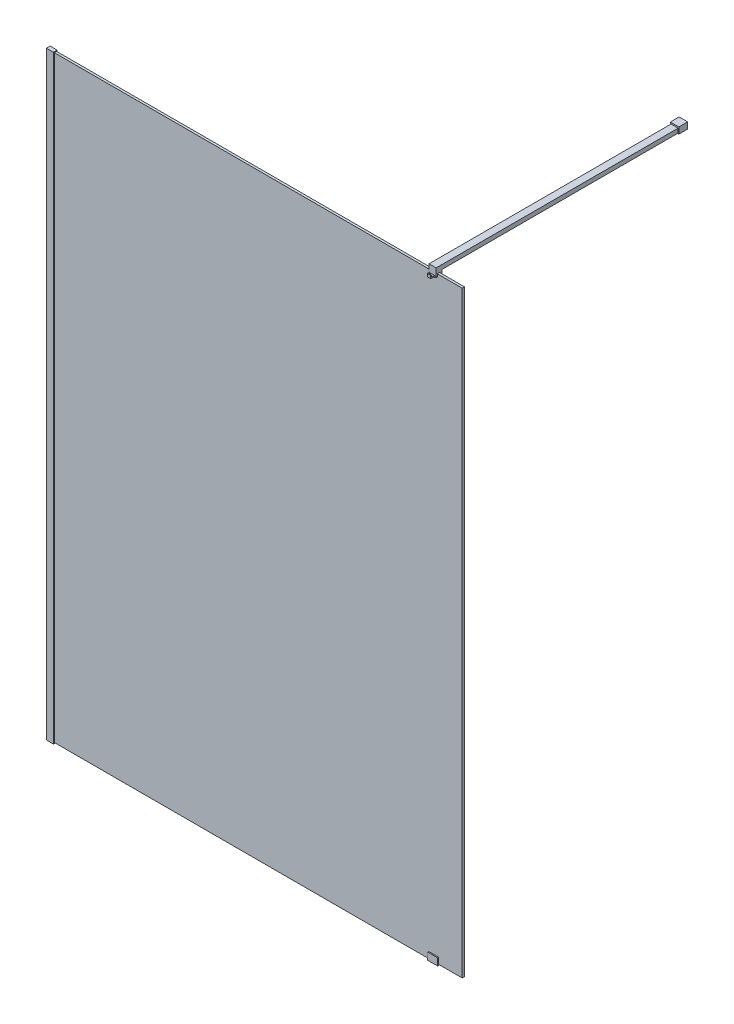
ISO-10303-21;
HEADER;
FILE_DESCRIPTION(('STEP AP214'),'2;1');
FILE_NAME('part.step','',(''),(''),'','','');
FILE_SCHEMA(('AUTOMOTIVE_DESIGN { 1 0 10303 214 1 1 1 1 }'));
ENDSEC;
DATA;
#1=APPLICATION_CONTEXT('core data for automotive mechanical design processes');
#2=APPLICATION_PROTOCOL_DEFINITION('international standard','automotive_design',2000,#1);
#3=PRODUCT_CONTEXT('',#1,'mechanical');
#4=PRODUCT('Part','Part','',(#3));
#5=PRODUCT_RELATED_PRODUCT_CATEGORY('part','',(#4));
#6=PRODUCT_DEFINITION_FORMATION('','',#4);
#7=PRODUCT_DEFINITION_CONTEXT('part definition',#1,'design');
#8=PRODUCT_DEFINITION('design','',#6,#7);
#9=PRODUCT_DEFINITION_SHAPE('','',#8);
#10=(LENGTH_UNIT() NAMED_UNIT(*) SI_UNIT(.MILLI.,.METRE.));
#11=(NAMED_UNIT(*) PLANE_ANGLE_UNIT() SI_UNIT($,.RADIAN.));
#12=(NAMED_UNIT(*) SI_UNIT($,.STERADIAN.) SOLID_ANGLE_UNIT());
#13=UNCERTAINTY_MEASURE_WITH_UNIT(LENGTH_MEASURE(1.E-05),#10,'distance_accuracy_value','');
#14=(GEOMETRIC_REPRESENTATION_CONTEXT(3) GLOBAL_UNCERTAINTY_ASSIGNED_CONTEXT((#13)) GLOBAL_UNIT_ASSIGNED_CONTEXT((#10,
#11,#12)) REPRESENTATION_CONTEXT('',''));
#15=CARTESIAN_POINT('',(0.,0.,0.));
#16=DIRECTION('',(0.,0.,1.));
#17=DIRECTION('',(1.,0.,0.));
#18=AXIS2_PLACEMENT_3D('',#15,#16,#17);
#19=CARTESIAN_POINT('',(1370.95,2090.,-19.4000000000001));
#20=DIRECTION('',(-1.,0.,0.));
#21=DIRECTION('',(0.,0.,1.));
#22=AXIS2_PLACEMENT_3D('',#19,#20,#21);
#23=PLANE('',#22);
#24=DIRECTION('',(0.,-1.,0.));
#25=VECTOR('',#24,1.);
#26=CARTESIAN_POINT('',(1370.95,2090.,-850.03));
#27=LINE('',#26,#25);
#28=CARTESIAN_POINT('',(1370.95,2120.,-850.03));
#29=VERTEX_POINT('',#28);
#30=CARTESIAN_POINT('',(1370.95,2105.,-850.03));
#31=VERTEX_POINT('',#30);
#32=EDGE_CURVE('E61',#29,#31,#27,.T.);
#33=ORIENTED_EDGE('',*,*,#32,.F.);
#34=DIRECTION('',(0.,0.,1.));
#35=VECTOR('',#34,1.);
#36=CARTESIAN_POINT('',(1370.95,2120.,0.599999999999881));
#37=LINE('',#36,#35);
#38=CARTESIAN_POINT('',(1370.95,2120.,0.599999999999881));
#39=VERTEX_POINT('',#38);
#40=EDGE_CURVE('E386',#29,#39,#37,.T.);
#41=ORIENTED_EDGE('',*,*,#40,.T.);
#42=DIRECTION('',(0.,-1.,0.));
#43=VECTOR('',#42,1.);
#44=CARTESIAN_POINT('',(1370.95,2094.,0.599999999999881));
#45=LINE('',#44,#43);
#46=CARTESIAN_POINT('',(1370.95,2094.,0.599999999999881));
#47=VERTEX_POINT('',#46);
#48=EDGE_CURVE('E388',#39,#47,#45,.T.);
#49=ORIENTED_EDGE('',*,*,#48,.T.);
#50=DIRECTION('',(0.,1.,0.));
#51=VECTOR('',#50,1.);
#52=CARTESIAN_POINT('',(1370.95,2090.,0.599999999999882));
#53=LINE('',#52,#51);
#54=CARTESIAN_POINT('',(1370.95,2090.,0.599999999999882));
#55=VERTEX_POINT('',#54);
#56=EDGE_CURVE('E332',#55,#47,#53,.T.);
#57=ORIENTED_EDGE('',*,*,#56,.F.);
#58=DIRECTION('',(0.,0.,-1.));
#59=VECTOR('',#58,1.);
#60=CARTESIAN_POINT('',(1370.95,2090.,-3.40000000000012));
#61=LINE('',#60,#59);
#62=CARTESIAN_POINT('',(1370.95,2090.,-3.40000000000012));
#63=VERTEX_POINT('',#62);
#64=EDGE_CURVE('E362',#55,#63,#61,.T.);
#65=ORIENTED_EDGE('',*,*,#64,.T.);
#66=DIRECTION('',(0.,1.,-1.30407837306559E-13));
#67=VECTOR('',#66,1.);
#68=CARTESIAN_POINT('',(1370.95,2100.,-3.40000000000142));
#69=LINE('',#68,#67);
#70=CARTESIAN_POINT('',(1370.95,2100.,-3.40000000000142));
#71=VERTEX_POINT('',#70);
#72=EDGE_CURVE('E392',#63,#71,#69,.T.);
#73=ORIENTED_EDGE('',*,*,#72,.T.);
#74=DIRECTION('',(0.,0.,-1.));
#75=VECTOR('',#74,1.);
#76=CARTESIAN_POINT('',(1370.95,2100.,-11.4000000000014));
#77=LINE('',#76,#75);
#78=CARTESIAN_POINT('',(1370.95,2100.,-11.4000000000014));
#79=VERTEX_POINT('',#78);
#80=EDGE_CURVE('E394',#71,#79,#77,.T.);
#81=ORIENTED_EDGE('',*,*,#80,.T.);
#82=DIRECTION('',(0.,-1.,1.30451205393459E-13));
#83=VECTOR('',#82,1.);
#84=CARTESIAN_POINT('',(1370.95,2090.,-11.4000000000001));
#85=LINE('',#84,#83);
#86=CARTESIAN_POINT('',(1370.95,2090.,-11.4000000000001));
#87=VERTEX_POINT('',#86);
#88=EDGE_CURVE('E395',#79,#87,#85,.T.);
#89=ORIENTED_EDGE('',*,*,#88,.T.);
#90=DIRECTION('',(0.,0.,-1.));
#91=VECTOR('',#90,1.);
#92=CARTESIAN_POINT('',(1370.95,2090.,-19.4000000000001));
#93=LINE('',#92,#91);
#94=CARTESIAN_POINT('',(1370.95,2090.,-19.4000000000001));
#95=VERTEX_POINT('',#94);
#96=EDGE_CURVE('E283',#87,#95,#93,.T.);
#97=ORIENTED_EDGE('',*,*,#96,.T.);
#98=DIRECTION('',(0.,1.,0.));
#99=VECTOR('',#98,1.);
#100=CARTESIAN_POINT('',(1370.95,2120.,-19.4000000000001));
#101=LINE('',#100,#99);
#102=CARTESIAN_POINT('',(1370.95,2105.,-19.4000000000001));
#103=VERTEX_POINT('',#102);
#104=EDGE_CURVE('E249',#95,#103,#101,.T.);
#105=ORIENTED_EDGE('',*,*,#104,.T.);
#106=DIRECTION('',(0.,0.,-1.));
#107=VECTOR('',#106,1.);
#108=CARTESIAN_POINT('',(1370.95,2105.,-881.03));
#109=LINE('',#108,#107);
#110=EDGE_CURVE('E248',#103,#31,#109,.T.);
#111=ORIENTED_EDGE('',*,*,#110,.T.);
#112=EDGE_LOOP('',(#33,#41,#49,#57,#65,#73,#81,#89,#97,#105,#111));
#113=FACE_BOUND('',#112,.T.);
#114=ADVANCED_FACE('F46',(#113),#23,.F.);
#115=CARTESIAN_POINT('',(1345.95,2090.,-19.4000000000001));
#116=DIRECTION('',(-1.,0.,0.));
#117=DIRECTION('',(0.,0.,1.));
#118=AXIS2_PLACEMENT_3D('',#115,#116,#117);
#119=PLANE('',#118);
#120=DIRECTION('',(0.,0.,1.));
#121=VECTOR('',#120,1.);
#122=CARTESIAN_POINT('',(1345.95,2120.,0.599999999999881));
#123=LINE('',#122,#121);
#124=CARTESIAN_POINT('',(1345.95,2120.,-850.03));
#125=VERTEX_POINT('',#124);
#126=CARTESIAN_POINT('',(1345.95,2120.,0.599999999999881));
#127=VERTEX_POINT('',#126);
#128=EDGE_CURVE('E272',#125,#127,#123,.T.);
#129=ORIENTED_EDGE('',*,*,#128,.F.);
#130=DIRECTION('',(0.,-1.,0.));
#131=VECTOR('',#130,1.);
#132=CARTESIAN_POINT('',(1345.95,2090.,-850.03));
#133=LINE('',#132,#131);
#134=CARTESIAN_POINT('',(1345.95,2105.,-850.03));
#135=VERTEX_POINT('',#134);
#136=EDGE_CURVE('E230',#125,#135,#133,.T.);
#137=ORIENTED_EDGE('',*,*,#136,.T.);
#138=DIRECTION('',(0.,0.,1.));
#139=VECTOR('',#138,1.);
#140=CARTESIAN_POINT('',(1345.95,2105.,-881.03));
#141=LINE('',#140,#139);
#142=CARTESIAN_POINT('',(1345.95,2105.,-19.4000000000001));
#143=VERTEX_POINT('',#142);
#144=EDGE_CURVE('E238',#135,#143,#141,.T.);
#145=ORIENTED_EDGE('',*,*,#144,.T.);
#146=DIRECTION('',(0.,1.,0.));
#147=VECTOR('',#146,1.);
#148=CARTESIAN_POINT('',(1345.95,2120.,-19.4000000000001));
#149=LINE('',#148,#147);
#150=CARTESIAN_POINT('',(1345.95,2090.,-19.4000000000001));
#151=VERTEX_POINT('',#150);
#152=EDGE_CURVE('E262',#151,#143,#149,.T.);
#153=ORIENTED_EDGE('',*,*,#152,.F.);
#154=DIRECTION('',(0.,0.,-1.));
#155=VECTOR('',#154,1.);
#156=CARTESIAN_POINT('',(1345.95,2090.,-19.4000000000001));
#157=LINE('',#156,#155);
#158=CARTESIAN_POINT('',(1345.95,2090.,-11.4000000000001));
#159=VERTEX_POINT('',#158);
#160=EDGE_CURVE('E296',#159,#151,#157,.T.);
#161=ORIENTED_EDGE('',*,*,#160,.F.);
#162=DIRECTION('',(0.,-1.,1.30451205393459E-13));
#163=VECTOR('',#162,1.);
#164=CARTESIAN_POINT('',(1345.95,2090.,-11.4000000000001));
#165=LINE('',#164,#163);
#166=CARTESIAN_POINT('',(1345.95,2100.,-11.4000000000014));
#167=VERTEX_POINT('',#166);
#168=EDGE_CURVE('E294',#167,#159,#165,.T.);
#169=ORIENTED_EDGE('',*,*,#168,.F.);
#170=DIRECTION('',(0.,0.,-1.));
#171=VECTOR('',#170,1.);
#172=CARTESIAN_POINT('',(1345.95,2100.,-11.4000000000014));
#173=LINE('',#172,#171);
#174=CARTESIAN_POINT('',(1345.95,2100.,-3.40000000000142));
#175=VERTEX_POINT('',#174);
#176=EDGE_CURVE('E292',#175,#167,#173,.T.);
#177=ORIENTED_EDGE('',*,*,#176,.F.);
#178=DIRECTION('',(0.,1.,-1.30407837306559E-13));
#179=VECTOR('',#178,1.);
#180=CARTESIAN_POINT('',(1345.95,2100.,-3.40000000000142));
#181=LINE('',#180,#179);
#182=CARTESIAN_POINT('',(1345.95,2090.,-3.40000000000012));
#183=VERTEX_POINT('',#182);
#184=EDGE_CURVE('E290',#183,#175,#181,.T.);
#185=ORIENTED_EDGE('',*,*,#184,.F.);
#186=DIRECTION('',(0.,0.,-1.));
#187=VECTOR('',#186,1.);
#188=CARTESIAN_POINT('',(1345.95,2090.,-3.40000000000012));
#189=LINE('',#188,#187);
#190=CARTESIAN_POINT('',(1345.95,2090.,0.599999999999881));
#191=VERTEX_POINT('',#190);
#192=EDGE_CURVE('E288',#191,#183,#189,.T.);
#193=ORIENTED_EDGE('',*,*,#192,.F.);
#194=DIRECTION('',(0.,1.,0.));
#195=VECTOR('',#194,1.);
#196=CARTESIAN_POINT('',(1345.95,2090.,0.599999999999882));
#197=LINE('',#196,#195);
#198=CARTESIAN_POINT('',(1345.95,2094.,0.599999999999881));
#199=VERTEX_POINT('',#198);
#200=EDGE_CURVE('E329',#191,#199,#197,.T.);
#201=ORIENTED_EDGE('',*,*,#200,.T.);
#202=DIRECTION('',(0.,-1.,0.));
#203=VECTOR('',#202,1.);
#204=CARTESIAN_POINT('',(1345.95,2094.,0.599999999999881));
#205=LINE('',#204,#203);
#206=EDGE_CURVE('E274',#127,#199,#205,.T.);
#207=ORIENTED_EDGE('',*,*,#206,.F.);
#208=EDGE_LOOP('',(#129,#137,#145,#153,#161,#169,#177,#185,#193,#201,#207));
#209=FACE_BOUND('',#208,.T.);
#210=ADVANCED_FACE('F259',(#209),#119,.T.);
#211=CARTESIAN_POINT('',(1370.95,2120.,0.599999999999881));
#212=DIRECTION('',(0.,-1.,0.));
#213=DIRECTION('',(0.,0.,-1.));
#214=AXIS2_PLACEMENT_3D('',#211,#212,#213);
#215=PLANE('',#214);
#216=DIRECTION('',(1.,0.,0.));
#217=VECTOR('',#216,1.);
#218=CARTESIAN_POINT('',(1370.95,2120.,-850.03));
#219=LINE('',#218,#217);
#220=EDGE_CURVE('E68',#125,#29,#219,.T.);
#221=ORIENTED_EDGE('',*,*,#220,.F.);
#222=ORIENTED_EDGE('',*,*,#128,.T.);
#223=DIRECTION('',(-1.,0.,0.));
#224=VECTOR('',#223,1.);
#225=CARTESIAN_POINT('',(1370.95,2120.,0.599999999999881));
#226=LINE('',#225,#224);
#227=EDGE_CURVE('E326',#39,#127,#226,.T.);
#228=ORIENTED_EDGE('',*,*,#227,.F.);
#229=ORIENTED_EDGE('',*,*,#40,.F.);
#230=EDGE_LOOP('',(#221,#222,#228,#229));
#231=FACE_BOUND('',#230,.T.);
#232=ADVANCED_FACE('F437',(#231),#215,.F.);
#233=CARTESIAN_POINT('',(1345.95,2105.,-19.4000000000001));
#234=DIRECTION('',(0.,1.,0.));
#235=DIRECTION('',(0.,0.,1.));
#236=AXIS2_PLACEMENT_3D('',#233,#234,#235);
#237=PLANE('',#236);
#238=DIRECTION('',(-1.,0.,0.));
#239=VECTOR('',#238,1.);
#240=CARTESIAN_POINT('',(1345.95,2105.,-850.03));
#241=LINE('',#240,#239);
#242=EDGE_CURVE('E12',#31,#135,#241,.T.);
#243=ORIENTED_EDGE('',*,*,#242,.F.);
#244=ORIENTED_EDGE('',*,*,#110,.F.);
#245=DIRECTION('',(1.,0.,0.));
#246=VECTOR('',#245,1.);
#247=CARTESIAN_POINT('',(1345.95,2105.,-19.4000000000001));
#248=LINE('',#247,#246);
#249=EDGE_CURVE('E244',#143,#103,#248,.T.);
#250=ORIENTED_EDGE('',*,*,#249,.F.);
#251=ORIENTED_EDGE('',*,*,#144,.F.);
#252=EDGE_LOOP('',(#243,#244,#250,#251));
#253=FACE_BOUND('',#252,.T.);
#254=ADVANCED_FACE('F265',(#253),#237,.F.);
#255=CARTESIAN_POINT('',(1370.95,2094.,9.84506801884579));
#256=DIRECTION('',(0.,-1.,0.));
#257=DIRECTION('',(0.,0.,-1.));
#258=AXIS2_PLACEMENT_3D('',#255,#256,#257);
#259=PLANE('',#258);
#260=DIRECTION('',(-0.906307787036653,0.,-0.422618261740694));
#261=VECTOR('',#260,1.);
#262=CARTESIAN_POINT('',(1370.02591161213,2094.,11.8267819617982));
#263=LINE('',#262,#261);
#264=CARTESIAN_POINT('',(1352.45,2094.,3.6309997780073));
#265=VERTEX_POINT('',#264);
#266=EDGE_CURVE('E365',#265,#199,#263,.T.);
#267=ORIENTED_EDGE('',*,*,#266,.F.);
#268=DIRECTION('',(0.,0.,-1.));
#269=VECTOR('',#268,1.);
#270=CARTESIAN_POINT('',(1352.45,2094.,9.84506801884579));
#271=LINE('',#270,#269);
#272=CARTESIAN_POINT('',(1352.45,2094.,9.84506801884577));
#273=VERTEX_POINT('',#272);
#274=EDGE_CURVE('E273',#273,#265,#271,.T.);
#275=ORIENTED_EDGE('',*,*,#274,.F.);
#276=DIRECTION('',(-1.,0.,0.));
#277=VECTOR('',#276,1.);
#278=CARTESIAN_POINT('',(1370.95,2094.,9.84506801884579));
#279=LINE('',#278,#277);
#280=CARTESIAN_POINT('',(1364.45,2094.,9.84506801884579));
#281=VERTEX_POINT('',#280);
#282=EDGE_CURVE('E320',#281,#273,#279,.T.);
#283=ORIENTED_EDGE('',*,*,#282,.F.);
#284=DIRECTION('',(0.,0.,1.));
#285=VECTOR('',#284,1.);
#286=CARTESIAN_POINT('',(1364.45,2094.,9.84506801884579));
#287=LINE('',#286,#285);
#288=CARTESIAN_POINT('',(1364.45,2094.,3.63099977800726));
#289=VERTEX_POINT('',#288);
#290=EDGE_CURVE('E379',#289,#281,#287,.T.);
#291=ORIENTED_EDGE('',*,*,#290,.F.);
#292=DIRECTION('',(-0.906307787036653,0.,0.422618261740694));
#293=VECTOR('',#292,1.);
#294=CARTESIAN_POINT('',(1367.40893350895,2094.,2.25122642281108));
#295=LINE('',#294,#293);
#296=EDGE_CURVE('E364',#47,#289,#295,.T.);
#297=ORIENTED_EDGE('',*,*,#296,.F.);
#298=DIRECTION('',(-1.,0.,0.));
#299=VECTOR('',#298,1.);
#300=CARTESIAN_POINT('',(1370.95,2094.,0.599999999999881));
#301=LINE('',#300,#299);
#302=EDGE_CURVE('E323',#47,#199,#301,.T.);
#303=ORIENTED_EDGE('',*,*,#302,.T.);
#304=EDGE_LOOP('',(#267,#275,#283,#291,#297,#303));
#305=FACE_BOUND('',#304,.T.);
#306=ADVANCED_FACE('F424',(#305),#259,.F.);
#307=CARTESIAN_POINT('',(1370.95,2100.,10.3700000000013));
#308=DIRECTION('',(0.,-0.087155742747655,0.996194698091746));
#309=DIRECTION('',(0.,-0.996194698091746,-0.087155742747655));
#310=AXIS2_PLACEMENT_3D('',#307,#308,#309);
#311=PLANE('',#310);
#312=DIRECTION('',(0.,-0.996194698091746,-0.087155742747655));
#313=VECTOR('',#312,1.);
#314=CARTESIAN_POINT('',(1352.45,2100.,10.3700000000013));
#315=LINE('',#314,#313);
#316=CARTESIAN_POINT('',(1352.45,2100.,10.3700000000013));
#317=VERTEX_POINT('',#316);
#318=EDGE_CURVE('E276',#317,#273,#315,.T.);
#319=ORIENTED_EDGE('',*,*,#318,.F.);
#320=DIRECTION('',(-1.,0.,0.));
#321=VECTOR('',#320,1.);
#322=CARTESIAN_POINT('',(1370.95,2100.,10.3700000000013));
#323=LINE('',#322,#321);
#324=CARTESIAN_POINT('',(1364.45,2100.,10.3700000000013));
#325=VERTEX_POINT('',#324);
#326=EDGE_CURVE('E317',#325,#317,#323,.T.);
#327=ORIENTED_EDGE('',*,*,#326,.F.);
#328=DIRECTION('',(0.,0.996194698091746,0.087155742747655));
#329=VECTOR('',#328,1.);
#330=CARTESIAN_POINT('',(1364.45,2100.,10.3700000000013));
#331=LINE('',#330,#329);
#332=EDGE_CURVE('E376',#281,#325,#331,.T.);
#333=ORIENTED_EDGE('',*,*,#332,.F.);
#334=ORIENTED_EDGE('',*,*,#282,.T.);
#335=EDGE_LOOP('',(#319,#327,#333,#334));
#336=FACE_BOUND('',#335,.T.);
#337=ADVANCED_FACE('F428',(#336),#311,.F.);
#338=CARTESIAN_POINT('',(1370.95,2100.,13.3700000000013));
#339=DIRECTION('',(0.,-1.,1.48029736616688E-13));
#340=DIRECTION('',(0.,-1.48029736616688E-13,-1.));
#341=AXIS2_PLACEMENT_3D('',#338,#339,#340);
#342=PLANE('',#341);
#343=DIRECTION('',(0.,-1.48029736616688E-13,-1.));
#344=VECTOR('',#343,1.);
#345=CARTESIAN_POINT('',(1352.45,2100.,13.3700000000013));
#346=LINE('',#345,#344);
#347=CARTESIAN_POINT('',(1352.45,2100.,13.3700000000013));
#348=VERTEX_POINT('',#347);
#349=EDGE_CURVE('E382',#348,#317,#346,.T.);
#350=ORIENTED_EDGE('',*,*,#349,.F.);
#351=DIRECTION('',(-1.,0.,0.));
#352=VECTOR('',#351,1.);
#353=CARTESIAN_POINT('',(1370.95,2100.,13.3700000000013));
#354=LINE('',#353,#352);
#355=CARTESIAN_POINT('',(1364.45,2100.,13.3700000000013));
#356=VERTEX_POINT('',#355);
#357=EDGE_CURVE('E314',#356,#348,#354,.T.);
#358=ORIENTED_EDGE('',*,*,#357,.F.);
#359=DIRECTION('',(0.,1.48029736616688E-13,1.));
#360=VECTOR('',#359,1.);
#361=CARTESIAN_POINT('',(1364.45,2100.,13.3700000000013));
#362=LINE('',#361,#360);
#363=EDGE_CURVE('E368',#325,#356,#362,.T.);
#364=ORIENTED_EDGE('',*,*,#363,.F.);
#365=ORIENTED_EDGE('',*,*,#326,.T.);
#366=EDGE_LOOP('',(#350,#358,#364,#365));
#367=FACE_BOUND('',#366,.T.);
#368=ADVANCED_FACE('F431',(#367),#342,.F.);
#369=CARTESIAN_POINT('',(1370.95,2090.,13.3700000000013));
#370=DIRECTION('',(0.,0.,-1.));
#371=DIRECTION('',(0.,1.,0.));
#372=AXIS2_PLACEMENT_3D('',#369,#370,#371);
#373=PLANE('',#372);
#374=ORIENTED_EDGE('',*,*,#357,.T.);
#375=DIRECTION('',(0.,-1.,0.));
#376=VECTOR('',#375,1.);
#377=CARTESIAN_POINT('',(1352.45,7948.62948032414,13.3700000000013));
#378=LINE('',#377,#376);
#379=CARTESIAN_POINT('',(1352.45,2090.,13.3700000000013));
#380=VERTEX_POINT('',#379);
#381=EDGE_CURVE('E345',#348,#380,#378,.T.);
#382=ORIENTED_EDGE('',*,*,#381,.T.);
#383=DIRECTION('',(-1.,0.,0.));
#384=VECTOR('',#383,1.);
#385=CARTESIAN_POINT('',(1370.95,2090.,13.3700000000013));
#386=LINE('',#385,#384);
#387=CARTESIAN_POINT('',(1364.45,2090.,13.3700000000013));
#388=VERTEX_POINT('',#387);
#389=EDGE_CURVE('E311',#388,#380,#386,.T.);
#390=ORIENTED_EDGE('',*,*,#389,.F.);
#391=DIRECTION('',(0.,-1.,0.));
#392=VECTOR('',#391,1.);
#393=CARTESIAN_POINT('',(1364.45,7948.62948032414,13.3700000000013));
#394=LINE('',#393,#392);
#395=EDGE_CURVE('E355',#356,#388,#394,.T.);
#396=ORIENTED_EDGE('',*,*,#395,.F.);
#397=EDGE_LOOP('',(#374,#382,#390,#396));
#398=FACE_BOUND('',#397,.T.);
#399=ADVANCED_FACE('F353',(#398),#373,.F.);
#400=CARTESIAN_POINT('',(1370.95,2090.,-3.40000000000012));
#401=DIRECTION('',(0.,1.,0.));
#402=DIRECTION('',(0.,0.,1.));
#403=AXIS2_PLACEMENT_3D('',#400,#401,#402);
#404=PLANE('',#403);
#405=DIRECTION('',(0.906307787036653,0.,0.422618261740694));
#406=VECTOR('',#405,1.);
#407=CARTESIAN_POINT('',(1364.95275623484,2090.,9.46113075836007));
#408=LINE('',#407,#406);
#409=CARTESIAN_POINT('',(1352.45,2090.,3.6309997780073));
#410=VERTEX_POINT('',#409);
#411=EDGE_CURVE('E370',#191,#410,#408,.T.);
#412=ORIENTED_EDGE('',*,*,#411,.F.);
#413=ORIENTED_EDGE('',*,*,#192,.T.);
#414=DIRECTION('',(-1.,0.,0.));
#415=VECTOR('',#414,1.);
#416=CARTESIAN_POINT('',(1370.95,2090.,-3.40000000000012));
#417=LINE('',#416,#415);
#418=EDGE_CURVE('E308',#63,#183,#417,.T.);
#419=ORIENTED_EDGE('',*,*,#418,.F.);
#420=ORIENTED_EDGE('',*,*,#64,.F.);
#421=DIRECTION('',(0.906307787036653,0.,-0.422618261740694));
#422=VECTOR('',#421,1.);
#423=CARTESIAN_POINT('',(1372.48208888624,2090.,-0.114424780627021));
#424=LINE('',#423,#422);
#425=CARTESIAN_POINT('',(1364.45,2090.,3.6309997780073));
#426=VERTEX_POINT('',#425);
#427=EDGE_CURVE('E360',#426,#55,#424,.T.);
#428=ORIENTED_EDGE('',*,*,#427,.F.);
#429=DIRECTION('',(0.,0.,-1.));
#430=VECTOR('',#429,1.);
#431=CARTESIAN_POINT('',(1364.45,2090.,-3.40000000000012));
#432=LINE('',#431,#430);
#433=EDGE_CURVE('E334',#388,#426,#432,.T.);
#434=ORIENTED_EDGE('',*,*,#433,.F.);
#435=ORIENTED_EDGE('',*,*,#389,.T.);
#436=DIRECTION('',(0.,0.,1.));
#437=VECTOR('',#436,1.);
#438=CARTESIAN_POINT('',(1352.45,2090.,-3.40000000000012));
#439=LINE('',#438,#437);
#440=EDGE_CURVE('E54',#410,#380,#439,.T.);
#441=ORIENTED_EDGE('',*,*,#440,.F.);
#442=EDGE_LOOP('',(#412,#413,#419,#420,#428,#434,#435,#441));
#443=FACE_BOUND('',#442,.T.);
#444=ADVANCED_FACE('F357',(#443),#404,.F.);
#445=CARTESIAN_POINT('',(1370.95,2120.,-19.4000000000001));
#446=DIRECTION('',(0.,0.,1.));
#447=DIRECTION('',(0.,-1.,0.));
#448=AXIS2_PLACEMENT_3D('',#445,#446,#447);
#449=PLANE('',#448);
#450=ORIENTED_EDGE('',*,*,#152,.T.);
#451=ORIENTED_EDGE('',*,*,#249,.T.);
#452=ORIENTED_EDGE('',*,*,#104,.F.);
#453=DIRECTION('',(-1.,0.,0.));
#454=VECTOR('',#453,1.);
#455=CARTESIAN_POINT('',(1370.95,2090.,-19.4000000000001));
#456=LINE('',#455,#454);
#457=EDGE_CURVE('E271',#95,#151,#456,.T.);
#458=ORIENTED_EDGE('',*,*,#457,.T.);
#459=EDGE_LOOP('',(#450,#451,#452,#458));
#460=FACE_BOUND('',#459,.T.);
#461=ADVANCED_FACE('F48',(#460),#449,.F.);
#462=CARTESIAN_POINT('',(1370.95,2094.,0.599999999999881));
#463=DIRECTION('',(0.,0.,-1.));
#464=DIRECTION('',(0.,1.,0.));
#465=AXIS2_PLACEMENT_3D('',#462,#463,#464);
#466=PLANE('',#465);
#467=ORIENTED_EDGE('',*,*,#206,.T.);
#468=ORIENTED_EDGE('',*,*,#302,.F.);
#469=ORIENTED_EDGE('',*,*,#48,.F.);
#470=ORIENTED_EDGE('',*,*,#227,.T.);
#471=EDGE_LOOP('',(#467,#468,#469,#470));
#472=FACE_BOUND('',#471,.T.);
#473=ADVANCED_FACE('F435',(#472),#466,.F.);
#474=CARTESIAN_POINT('',(1370.95,2100.,-3.40000000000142));
#475=DIRECTION('',(0.,1.30407837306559E-13,1.));
#476=DIRECTION('',(0.,-1.,1.30407837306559E-13));
#477=AXIS2_PLACEMENT_3D('',#474,#475,#476);
#478=PLANE('',#477);
#479=ORIENTED_EDGE('',*,*,#184,.T.);
#480=DIRECTION('',(-1.,0.,0.));
#481=VECTOR('',#480,1.);
#482=CARTESIAN_POINT('',(1370.95,2100.,-3.40000000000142));
#483=LINE('',#482,#481);
#484=EDGE_CURVE('E305',#71,#175,#483,.T.);
#485=ORIENTED_EDGE('',*,*,#484,.F.);
#486=ORIENTED_EDGE('',*,*,#72,.F.);
#487=ORIENTED_EDGE('',*,*,#418,.T.);
#488=EDGE_LOOP('',(#479,#485,#486,#487));
#489=FACE_BOUND('',#488,.T.);
#490=ADVANCED_FACE('F413',(#489),#478,.F.);
#491=CARTESIAN_POINT('',(1370.95,2100.,-11.4000000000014));
#492=DIRECTION('',(0.,1.,0.));
#493=DIRECTION('',(0.,0.,1.));
#494=AXIS2_PLACEMENT_3D('',#491,#492,#493);
#495=PLANE('',#494);
#496=ORIENTED_EDGE('',*,*,#176,.T.);
#497=DIRECTION('',(-1.,0.,0.));
#498=VECTOR('',#497,1.);
#499=CARTESIAN_POINT('',(1370.95,2100.,-11.4000000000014));
#500=LINE('',#499,#498);
#501=EDGE_CURVE('E302',#79,#167,#500,.T.);
#502=ORIENTED_EDGE('',*,*,#501,.F.);
#503=ORIENTED_EDGE('',*,*,#80,.F.);
#504=ORIENTED_EDGE('',*,*,#484,.T.);
#505=EDGE_LOOP('',(#496,#502,#503,#504));
#506=FACE_BOUND('',#505,.T.);
#507=ADVANCED_FACE('F409',(#506),#495,.F.);
#508=CARTESIAN_POINT('',(1370.95,2090.,-11.4000000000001));
#509=DIRECTION('',(0.,-1.30451205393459E-13,-1.));
#510=DIRECTION('',(0.,1.,-1.30451205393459E-13));
#511=AXIS2_PLACEMENT_3D('',#508,#509,#510);
#512=PLANE('',#511);
#513=ORIENTED_EDGE('',*,*,#168,.T.);
#514=DIRECTION('',(-1.,0.,0.));
#515=VECTOR('',#514,1.);
#516=CARTESIAN_POINT('',(1370.95,2090.,-11.4000000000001));
#517=LINE('',#516,#515);
#518=EDGE_CURVE('E299',#87,#159,#517,.T.);
#519=ORIENTED_EDGE('',*,*,#518,.F.);
#520=ORIENTED_EDGE('',*,*,#88,.F.);
#521=ORIENTED_EDGE('',*,*,#501,.T.);
#522=EDGE_LOOP('',(#513,#519,#520,#521));
#523=FACE_BOUND('',#522,.T.);
#524=ADVANCED_FACE('F405',(#523),#512,.F.);
#525=CARTESIAN_POINT('',(1370.95,2090.,-19.4000000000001));
#526=DIRECTION('',(0.,1.,0.));
#527=DIRECTION('',(0.,0.,1.));
#528=AXIS2_PLACEMENT_3D('',#525,#526,#527);
#529=PLANE('',#528);
#530=ORIENTED_EDGE('',*,*,#160,.T.);
#531=ORIENTED_EDGE('',*,*,#457,.F.);
#532=ORIENTED_EDGE('',*,*,#96,.F.);
#533=ORIENTED_EDGE('',*,*,#518,.T.);
#534=EDGE_LOOP('',(#530,#531,#532,#533));
#535=FACE_BOUND('',#534,.T.);
#536=ADVANCED_FACE('F400',(#535),#529,.F.);
#537=CARTESIAN_POINT('',(1345.95,7948.62948032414,0.599999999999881));
#538=DIRECTION('',(-0.422618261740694,0.,0.906307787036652));
#539=DIRECTION('',(0.906307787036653,0.,0.422618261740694));
#540=AXIS2_PLACEMENT_3D('',#537,#538,#539);
#541=PLANE('',#540);
#542=DIRECTION('',(0.,-1.,0.));
#543=VECTOR('',#542,1.);
#544=CARTESIAN_POINT('',(1352.45,7948.62948032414,3.6309997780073));
#545=LINE('',#544,#543);
#546=EDGE_CURVE('E348',#265,#410,#545,.T.);
#547=ORIENTED_EDGE('',*,*,#546,.F.);
#548=ORIENTED_EDGE('',*,*,#266,.T.);
#549=ORIENTED_EDGE('',*,*,#200,.F.);
#550=ORIENTED_EDGE('',*,*,#411,.T.);
#551=EDGE_LOOP('',(#547,#548,#549,#550));
#552=FACE_BOUND('',#551,.T.);
#553=ADVANCED_FACE('F432',(#552),#541,.T.);
#554=CARTESIAN_POINT('',(1352.45,7948.62948032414,3.6309997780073));
#555=DIRECTION('',(-1.,0.,0.));
#556=DIRECTION('',(0.,0.,1.));
#557=AXIS2_PLACEMENT_3D('',#554,#555,#556);
#558=PLANE('',#557);
#559=ORIENTED_EDGE('',*,*,#318,.T.);
#560=ORIENTED_EDGE('',*,*,#274,.T.);
#561=ORIENTED_EDGE('',*,*,#546,.T.);
#562=ORIENTED_EDGE('',*,*,#440,.T.);
#563=ORIENTED_EDGE('',*,*,#381,.F.);
#564=ORIENTED_EDGE('',*,*,#349,.T.);
#565=EDGE_LOOP('',(#559,#560,#561,#562,#563,#564));
#566=FACE_BOUND('',#565,.T.);
#567=ADVANCED_FACE('F344',(#566),#558,.T.);
#568=CARTESIAN_POINT('',(1364.45,7948.62948032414,3.6309997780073));
#569=DIRECTION('',(1.,0.,0.));
#570=DIRECTION('',(0.,0.,-1.));
#571=AXIS2_PLACEMENT_3D('',#568,#569,#570);
#572=PLANE('',#571);
#573=DIRECTION('',(0.,-1.,0.));
#574=VECTOR('',#573,1.);
#575=CARTESIAN_POINT('',(1364.45,7948.62948032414,3.6309997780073));
#576=LINE('',#575,#574);
#577=EDGE_CURVE('E241',#289,#426,#576,.T.);
#578=ORIENTED_EDGE('',*,*,#577,.F.);
#579=ORIENTED_EDGE('',*,*,#290,.T.);
#580=ORIENTED_EDGE('',*,*,#332,.T.);
#581=ORIENTED_EDGE('',*,*,#363,.T.);
#582=ORIENTED_EDGE('',*,*,#395,.T.);
#583=ORIENTED_EDGE('',*,*,#433,.T.);
#584=EDGE_LOOP('',(#578,#579,#580,#581,#582,#583));
#585=FACE_BOUND('',#584,.T.);
#586=ADVANCED_FACE('F420',(#585),#572,.T.);
#587=CARTESIAN_POINT('',(1370.95,7948.62948032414,0.599999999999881));
#588=DIRECTION('',(0.422618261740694,0.,0.906307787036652));
#589=DIRECTION('',(0.906307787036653,0.,-0.422618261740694));
#590=AXIS2_PLACEMENT_3D('',#587,#588,#589);
#591=PLANE('',#590);
#592=ORIENTED_EDGE('',*,*,#56,.T.);
#593=ORIENTED_EDGE('',*,*,#296,.T.);
#594=ORIENTED_EDGE('',*,*,#577,.T.);
#595=ORIENTED_EDGE('',*,*,#427,.T.);
#596=EDGE_LOOP('',(#592,#593,#594,#595));
#597=FACE_BOUND('',#596,.T.);
#598=ADVANCED_FACE('F418',(#597),#591,.T.);
#599=CARTESIAN_POINT('',(1343.44999999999,2103.,-850.03));
#600=DIRECTION('',(0.,0.,-1.));
#601=DIRECTION('',(-1.,0.,0.));
#602=AXIS2_PLACEMENT_3D('',#599,#600,#601);
#603=PLANE('',#602);
#604=DIRECTION('',(0.,1.,0.));
#605=VECTOR('',#604,1.);
#606=CARTESIAN_POINT('',(1343.44999999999,2125.,-850.03));
#607=LINE('',#606,#605);
#608=CARTESIAN_POINT('',(1343.44999999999,2103.,-850.03));
#609=VERTEX_POINT('',#608);
#610=CARTESIAN_POINT('',(1343.44999999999,2125.,-850.03));
#611=VERTEX_POINT('',#610);
#612=EDGE_CURVE('E209',#609,#611,#607,.T.);
#613=ORIENTED_EDGE('',*,*,#612,.F.);
#614=DIRECTION('',(-1.,0.,0.));
#615=VECTOR('',#614,1.);
#616=CARTESIAN_POINT('',(1373.44999999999,2103.,-850.03));
#617=LINE('',#616,#615);
#618=CARTESIAN_POINT('',(1373.44999999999,2103.,-850.03));
#619=VERTEX_POINT('',#618);
#620=EDGE_CURVE('E201',#619,#609,#617,.T.);
#621=ORIENTED_EDGE('',*,*,#620,.F.);
#622=DIRECTION('',(0.,-1.,0.));
#623=VECTOR('',#622,1.);
#624=CARTESIAN_POINT('',(1373.44999999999,2125.,-850.03));
#625=LINE('',#624,#623);
#626=CARTESIAN_POINT('',(1373.44999999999,2125.,-850.03));
#627=VERTEX_POINT('',#626);
#628=EDGE_CURVE('E212',#627,#619,#625,.T.);
#629=ORIENTED_EDGE('',*,*,#628,.F.);
#630=DIRECTION('',(1.,0.,0.));
#631=VECTOR('',#630,1.);
#632=CARTESIAN_POINT('',(1373.44999999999,2125.,-850.03));
#633=LINE('',#632,#631);
#634=EDGE_CURVE('E193',#611,#627,#633,.T.);
#635=ORIENTED_EDGE('',*,*,#634,.F.);
#636=EDGE_LOOP('',(#613,#621,#629,#635));
#637=FACE_BOUND('',#636,.T.);
#638=ORIENTED_EDGE('',*,*,#136,.F.);
#639=ORIENTED_EDGE('',*,*,#220,.T.);
#640=ORIENTED_EDGE('',*,*,#32,.T.);
#641=ORIENTED_EDGE('',*,*,#242,.T.);
#642=EDGE_LOOP('',(#638,#639,#640,#641));
#643=FACE_BOUND('',#642,.T.);
#644=ADVANCED_FACE('F206',(#637,#643),#603,.F.);
#645=CARTESIAN_POINT('',(1343.44999999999,2125.,-850.03));
#646=DIRECTION('',(-1.,0.,0.));
#647=DIRECTION('',(0.,0.,1.));
#648=AXIS2_PLACEMENT_3D('',#645,#646,#647);
#649=PLANE('',#648);
#650=DIRECTION('',(0.,1.,0.));
#651=VECTOR('',#650,1.);
#652=CARTESIAN_POINT('',(1343.44999999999,2125.,-881.03));
#653=LINE('',#652,#651);
#654=CARTESIAN_POINT('',(1343.44999999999,2103.,-881.03));
#655=VERTEX_POINT('',#654);
#656=CARTESIAN_POINT('',(1343.44999999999,2125.,-881.03));
#657=VERTEX_POINT('',#656);
#658=EDGE_CURVE('E224',#655,#657,#653,.T.);
#659=ORIENTED_EDGE('',*,*,#658,.F.);
#660=DIRECTION('',(0.,0.,-1.));
#661=VECTOR('',#660,1.);
#662=CARTESIAN_POINT('',(1343.44999999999,2103.,-850.03));
#663=LINE('',#662,#661);
#664=EDGE_CURVE('E215',#609,#655,#663,.T.);
#665=ORIENTED_EDGE('',*,*,#664,.F.);
#666=ORIENTED_EDGE('',*,*,#612,.T.);
#667=DIRECTION('',(0.,0.,-1.));
#668=VECTOR('',#667,1.);
#669=CARTESIAN_POINT('',(1343.44999999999,2125.,-850.03));
#670=LINE('',#669,#668);
#671=EDGE_CURVE('E190',#611,#657,#670,.T.);
#672=ORIENTED_EDGE('',*,*,#671,.T.);
#673=EDGE_LOOP('',(#659,#665,#666,#672));
#674=FACE_BOUND('',#673,.T.);
#675=ADVANCED_FACE('F214',(#674),#649,.T.);
#676=CARTESIAN_POINT('',(1373.44999999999,2103.,-850.03));
#677=DIRECTION('',(0.,-1.,0.));
#678=DIRECTION('',(0.,0.,-1.));
#679=AXIS2_PLACEMENT_3D('',#676,#677,#678);
#680=PLANE('',#679);
#681=DIRECTION('',(-1.,0.,0.));
#682=VECTOR('',#681,1.);
#683=CARTESIAN_POINT('',(1373.44999999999,2103.,-881.03));
#684=LINE('',#683,#682);
#685=CARTESIAN_POINT('',(1373.44999999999,2103.,-881.03));
#686=VERTEX_POINT('',#685);
#687=EDGE_CURVE('E216',#686,#655,#684,.T.);
#688=ORIENTED_EDGE('',*,*,#687,.F.);
#689=DIRECTION('',(0.,0.,-1.));
#690=VECTOR('',#689,1.);
#691=CARTESIAN_POINT('',(1373.44999999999,2103.,-850.03));
#692=LINE('',#691,#690);
#693=EDGE_CURVE('E231',#619,#686,#692,.T.);
#694=ORIENTED_EDGE('',*,*,#693,.F.);
#695=ORIENTED_EDGE('',*,*,#620,.T.);
#696=ORIENTED_EDGE('',*,*,#664,.T.);
#697=EDGE_LOOP('',(#688,#694,#695,#696));
#698=FACE_BOUND('',#697,.T.);
#699=ADVANCED_FACE('F444',(#698),#680,.T.);
#700=CARTESIAN_POINT('',(1373.44999999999,2125.,-850.03));
#701=DIRECTION('',(1.,0.,0.));
#702=DIRECTION('',(0.,1.,0.));
#703=AXIS2_PLACEMENT_3D('',#700,#701,#702);
#704=PLANE('',#703);
#705=DIRECTION('',(0.,-1.,0.));
#706=VECTOR('',#705,1.);
#707=CARTESIAN_POINT('',(1373.44999999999,2125.,-881.03));
#708=LINE('',#707,#706);
#709=CARTESIAN_POINT('',(1373.44999999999,2125.,-881.03));
#710=VERTEX_POINT('',#709);
#711=EDGE_CURVE('E219',#710,#686,#708,.T.);
#712=ORIENTED_EDGE('',*,*,#711,.F.);
#713=DIRECTION('',(0.,0.,-1.));
#714=VECTOR('',#713,1.);
#715=CARTESIAN_POINT('',(1373.44999999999,2125.,-850.03));
#716=LINE('',#715,#714);
#717=EDGE_CURVE('E200',#627,#710,#716,.T.);
#718=ORIENTED_EDGE('',*,*,#717,.F.);
#719=ORIENTED_EDGE('',*,*,#628,.T.);
#720=ORIENTED_EDGE('',*,*,#693,.T.);
#721=EDGE_LOOP('',(#712,#718,#719,#720));
#722=FACE_BOUND('',#721,.T.);
#723=ADVANCED_FACE('F612',(#722),#704,.T.);
#724=CARTESIAN_POINT('',(1373.44999999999,2125.,-850.03));
#725=DIRECTION('',(0.,1.,0.));
#726=DIRECTION('',(0.,0.,1.));
#727=AXIS2_PLACEMENT_3D('',#724,#725,#726);
#728=PLANE('',#727);
#729=DIRECTION('',(1.,0.,0.));
#730=VECTOR('',#729,1.);
#731=CARTESIAN_POINT('',(1373.44999999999,2125.,-881.03));
#732=LINE('',#731,#730);
#733=EDGE_CURVE('E195',#657,#710,#732,.T.);
#734=ORIENTED_EDGE('',*,*,#733,.F.);
#735=ORIENTED_EDGE('',*,*,#671,.F.);
#736=ORIENTED_EDGE('',*,*,#634,.T.);
#737=ORIENTED_EDGE('',*,*,#717,.T.);
#738=EDGE_LOOP('',(#734,#735,#736,#737));
#739=FACE_BOUND('',#738,.T.);
#740=ADVANCED_FACE('F192',(#739),#728,.T.);
#741=CARTESIAN_POINT('',(1345.95,2105.,-881.03));
#742=DIRECTION('',(0.,0.,-1.));
#743=DIRECTION('',(-1.,0.,0.));
#744=AXIS2_PLACEMENT_3D('',#741,#742,#743);
#745=PLANE('',#744);
#746=ORIENTED_EDGE('',*,*,#658,.T.);
#747=ORIENTED_EDGE('',*,*,#733,.T.);
#748=ORIENTED_EDGE('',*,*,#711,.T.);
#749=ORIENTED_EDGE('',*,*,#687,.T.);
#750=EDGE_LOOP('',(#746,#747,#748,#749));
#751=FACE_BOUND('',#750,.T.);
#752=ADVANCED_FACE('F485',(#751),#745,.T.);
#753=CLOSED_SHELL('',(#114,#210,#232,#254,#306,#337,#368,#399,#444,#461,#473,#490,#507,#524,
#536,#553,#567,#586,#598,#644,#675,#699,#723,#740,#752));
#754=MANIFOLD_SOLID_BREP('B2',#753);
#755=CARTESIAN_POINT('',(1375.95,22.,-11.4000000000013));
#756=DIRECTION('',(0.,0.,-1.));
#757=DIRECTION('',(0.,1.,0.));
#758=AXIS2_PLACEMENT_3D('',#755,#756,#757);
#759=PLANE('',#758);
#760=DIRECTION('',(0.,-1.,0.));
#761=VECTOR('',#760,1.);
#762=CARTESIAN_POINT('',(1340.95,22.,-11.4000000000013));
#763=LINE('',#762,#761);
#764=CARTESIAN_POINT('',(1340.95,22.,-11.4000000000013));
#765=VERTEX_POINT('',#764);
#766=CARTESIAN_POINT('',(1340.95,0.,-11.4));
#767=VERTEX_POINT('',#766);
#768=EDGE_CURVE('E765',#765,#767,#763,.T.);
#769=ORIENTED_EDGE('',*,*,#768,.T.);
#770=DIRECTION('',(-1.,0.,0.));
#771=VECTOR('',#770,1.);
#772=CARTESIAN_POINT('',(1375.95,0.,-11.4));
#773=LINE('',#772,#771);
#774=CARTESIAN_POINT('',(1375.95,0.,-11.4));
#775=VERTEX_POINT('',#774);
#776=EDGE_CURVE('E44',#775,#767,#773,.T.);
#777=ORIENTED_EDGE('',*,*,#776,.F.);
#778=DIRECTION('',(0.,-1.,0.));
#779=VECTOR('',#778,1.);
#780=CARTESIAN_POINT('',(1375.95,22.,-11.4000000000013));
#781=LINE('',#780,#779);
#782=CARTESIAN_POINT('',(1375.95,22.,-11.4000000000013));
#783=VERTEX_POINT('',#782);
#784=EDGE_CURVE('E779',#783,#775,#781,.T.);
#785=ORIENTED_EDGE('',*,*,#784,.F.);
#786=DIRECTION('',(-1.,0.,0.));
#787=VECTOR('',#786,1.);
#788=CARTESIAN_POINT('',(1375.95,22.,-11.4000000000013));
#789=LINE('',#788,#787);
#790=EDGE_CURVE('E761',#783,#765,#789,.T.);
#791=ORIENTED_EDGE('',*,*,#790,.T.);
#792=EDGE_LOOP('',(#769,#777,#785,#791));
#793=FACE_BOUND('',#792,.T.);
#794=ADVANCED_FACE('F669',(#793),#759,.F.);
#795=CARTESIAN_POINT('',(1375.95,0.,-11.4));
#796=DIRECTION('',(0.,-1.,0.));
#797=DIRECTION('',(0.,0.,-1.));
#798=AXIS2_PLACEMENT_3D('',#795,#796,#797);
#799=PLANE('',#798);
#800=DIRECTION('',(0.,0.,1.));
#801=VECTOR('',#800,1.);
#802=CARTESIAN_POINT('',(1340.95,0.,-11.4));
#803=LINE('',#802,#801);
#804=CARTESIAN_POINT('',(1340.95,0.,-3.4));
#805=VERTEX_POINT('',#804);
#806=EDGE_CURVE('E768',#767,#805,#803,.T.);
#807=ORIENTED_EDGE('',*,*,#806,.T.);
#808=DIRECTION('',(-1.,0.,0.));
#809=VECTOR('',#808,1.);
#810=CARTESIAN_POINT('',(1375.95,0.,-3.4));
#811=LINE('',#810,#809);
#812=CARTESIAN_POINT('',(1375.95,0.,-3.4));
#813=VERTEX_POINT('',#812);
#814=EDGE_CURVE('E677',#813,#805,#811,.T.);
#815=ORIENTED_EDGE('',*,*,#814,.F.);
#816=DIRECTION('',(0.,0.,1.));
#817=VECTOR('',#816,1.);
#818=CARTESIAN_POINT('',(1375.95,0.,-11.4));
#819=LINE('',#818,#817);
#820=EDGE_CURVE('E728',#775,#813,#819,.T.);
#821=ORIENTED_EDGE('',*,*,#820,.F.);
#822=ORIENTED_EDGE('',*,*,#776,.T.);
#823=EDGE_LOOP('',(#807,#815,#821,#822));
#824=FACE_BOUND('',#823,.T.);
#825=ADVANCED_FACE('F814',(#824),#799,.F.);
#826=CARTESIAN_POINT('',(1375.95,0.,-3.4));
#827=DIRECTION('',(0.,0.,1.));
#828=DIRECTION('',(0.,-1.,0.));
#829=AXIS2_PLACEMENT_3D('',#826,#827,#828);
#830=PLANE('',#829);
#831=DIRECTION('',(0.,1.,0.));
#832=VECTOR('',#831,1.);
#833=CARTESIAN_POINT('',(1340.95,0.,-3.4));
#834=LINE('',#833,#832);
#835=CARTESIAN_POINT('',(1340.95,21.9999999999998,-3.4000000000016));
#836=VERTEX_POINT('',#835);
#837=EDGE_CURVE('E770',#805,#836,#834,.T.);
#838=ORIENTED_EDGE('',*,*,#837,.T.);
#839=DIRECTION('',(-1.,0.,0.));
#840=VECTOR('',#839,1.);
#841=CARTESIAN_POINT('',(1375.95,21.9999999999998,-3.4000000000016));
#842=LINE('',#841,#840);
#843=CARTESIAN_POINT('',(1375.95,21.9999999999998,-3.4000000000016));
#844=VERTEX_POINT('',#843);
#845=EDGE_CURVE('E786',#844,#836,#842,.T.);
#846=ORIENTED_EDGE('',*,*,#845,.F.);
#847=DIRECTION('',(0.,1.,0.));
#848=VECTOR('',#847,1.);
#849=CARTESIAN_POINT('',(1375.95,0.,-3.4));
#850=LINE('',#849,#848);
#851=EDGE_CURVE('E794',#813,#844,#850,.T.);
#852=ORIENTED_EDGE('',*,*,#851,.F.);
#853=ORIENTED_EDGE('',*,*,#814,.T.);
#854=EDGE_LOOP('',(#838,#846,#852,#853));
#855=FACE_BOUND('',#854,.T.);
#856=ADVANCED_FACE('F792',(#855),#830,.F.);
#857=CARTESIAN_POINT('',(1375.95,22.,0.349999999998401));
#858=DIRECTION('',(0.,-1.,0.));
#859=DIRECTION('',(0.,0.,-1.));
#860=AXIS2_PLACEMENT_3D('',#857,#858,#859);
#861=PLANE('',#860);
#862=DIRECTION('',(0.,0.,1.));
#863=VECTOR('',#862,1.);
#864=CARTESIAN_POINT('',(1340.95,22.,0.349999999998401));
#865=LINE('',#864,#863);
#866=CARTESIAN_POINT('',(1340.95,22.,0.349999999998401));
#867=VERTEX_POINT('',#866);
#868=EDGE_CURVE('E772',#836,#867,#865,.T.);
#869=ORIENTED_EDGE('',*,*,#868,.T.);
#870=DIRECTION('',(-1.,0.,0.));
#871=VECTOR('',#870,1.);
#872=CARTESIAN_POINT('',(1375.95,22.,0.349999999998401));
#873=LINE('',#872,#871);
#874=CARTESIAN_POINT('',(1375.95,22.,0.349999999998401));
#875=VERTEX_POINT('',#874);
#876=EDGE_CURVE('E783',#875,#867,#873,.T.);
#877=ORIENTED_EDGE('',*,*,#876,.F.);
#878=DIRECTION('',(0.,0.,1.));
#879=VECTOR('',#878,1.);
#880=CARTESIAN_POINT('',(1375.95,22.,0.349999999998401));
#881=LINE('',#880,#879);
#882=EDGE_CURVE('E806',#844,#875,#881,.T.);
#883=ORIENTED_EDGE('',*,*,#882,.F.);
#884=ORIENTED_EDGE('',*,*,#845,.T.);
#885=EDGE_LOOP('',(#869,#877,#883,#884));
#886=FACE_BOUND('',#885,.T.);
#887=ADVANCED_FACE('F802',(#886),#861,.F.);
#888=CARTESIAN_POINT('',(1375.95,-3.,0.349999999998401));
#889=DIRECTION('',(0.,0.,-1.));
#890=DIRECTION('',(-1.,0.,0.));
#891=AXIS2_PLACEMENT_3D('',#888,#889,#890);
#892=PLANE('',#891);
#893=DIRECTION('',(0.,-1.,0.));
#894=VECTOR('',#893,1.);
#895=CARTESIAN_POINT('',(1340.95,-3.,0.349999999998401));
#896=LINE('',#895,#894);
#897=CARTESIAN_POINT('',(1340.95,-3.,0.349999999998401));
#898=VERTEX_POINT('',#897);
#899=EDGE_CURVE('E774',#867,#898,#896,.T.);
#900=ORIENTED_EDGE('',*,*,#899,.T.);
#901=DIRECTION('',(-1.,0.,0.));
#902=VECTOR('',#901,1.);
#903=CARTESIAN_POINT('',(1375.95,-3.,0.349999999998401));
#904=LINE('',#903,#902);
#905=CARTESIAN_POINT('',(1375.95,-3.,0.349999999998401));
#906=VERTEX_POINT('',#905);
#907=EDGE_CURVE('E756',#906,#898,#904,.T.);
#908=ORIENTED_EDGE('',*,*,#907,.F.);
#909=DIRECTION('',(0.,-1.,0.));
#910=VECTOR('',#909,1.);
#911=CARTESIAN_POINT('',(1375.95,-3.,0.349999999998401));
#912=LINE('',#911,#910);
#913=EDGE_CURVE('E747',#875,#906,#912,.T.);
#914=ORIENTED_EDGE('',*,*,#913,.F.);
#915=ORIENTED_EDGE('',*,*,#876,.T.);
#916=EDGE_LOOP('',(#900,#908,#914,#915));
#917=FACE_BOUND('',#916,.T.);
#918=ADVANCED_FACE('F805',(#917),#892,.F.);
#919=CARTESIAN_POINT('',(1375.95,-3.,-15.7500000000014));
#920=DIRECTION('',(0.,1.,0.));
#921=DIRECTION('',(0.,0.,1.));
#922=AXIS2_PLACEMENT_3D('',#919,#920,#921);
#923=PLANE('',#922);
#924=DIRECTION('',(0.,0.,-1.));
#925=VECTOR('',#924,1.);
#926=CARTESIAN_POINT('',(1340.95,-3.,-15.7500000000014));
#927=LINE('',#926,#925);
#928=CARTESIAN_POINT('',(1340.95,-3.,-15.7500000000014));
#929=VERTEX_POINT('',#928);
#930=EDGE_CURVE('E755',#898,#929,#927,.T.);
#931=ORIENTED_EDGE('',*,*,#930,.T.);
#932=DIRECTION('',(-1.,0.,0.));
#933=VECTOR('',#932,1.);
#934=CARTESIAN_POINT('',(1375.95,-3.,-15.7500000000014));
#935=LINE('',#934,#933);
#936=CARTESIAN_POINT('',(1375.95,-3.,-15.7500000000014));
#937=VERTEX_POINT('',#936);
#938=EDGE_CURVE('E752',#937,#929,#935,.T.);
#939=ORIENTED_EDGE('',*,*,#938,.F.);
#940=DIRECTION('',(0.,0.,-1.));
#941=VECTOR('',#940,1.);
#942=CARTESIAN_POINT('',(1375.95,-3.,-15.7500000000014));
#943=LINE('',#942,#941);
#944=EDGE_CURVE('E741',#906,#937,#943,.T.);
#945=ORIENTED_EDGE('',*,*,#944,.F.);
#946=ORIENTED_EDGE('',*,*,#907,.T.);
#947=EDGE_LOOP('',(#931,#939,#945,#946));
#948=FACE_BOUND('',#947,.T.);
#949=ADVANCED_FACE('F753',(#948),#923,.F.);
#950=CARTESIAN_POINT('',(1375.95,22.,-15.7500000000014));
#951=DIRECTION('',(0.,0.,1.));
#952=DIRECTION('',(0.,-1.,0.));
#953=AXIS2_PLACEMENT_3D('',#950,#951,#952);
#954=PLANE('',#953);
#955=DIRECTION('',(0.,1.,0.));
#956=VECTOR('',#955,1.);
#957=CARTESIAN_POINT('',(1340.95,22.,-15.7500000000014));
#958=LINE('',#957,#956);
#959=CARTESIAN_POINT('',(1340.95,22.,-15.7500000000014));
#960=VERTEX_POINT('',#959);
#961=EDGE_CURVE('E714',#929,#960,#958,.T.);
#962=ORIENTED_EDGE('',*,*,#961,.T.);
#963=DIRECTION('',(-1.,0.,0.));
#964=VECTOR('',#963,1.);
#965=CARTESIAN_POINT('',(1375.95,22.,-15.7500000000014));
#966=LINE('',#965,#964);
#967=CARTESIAN_POINT('',(1375.95,22.,-15.7500000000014));
#968=VERTEX_POINT('',#967);
#969=EDGE_CURVE('E757',#968,#960,#966,.T.);
#970=ORIENTED_EDGE('',*,*,#969,.F.);
#971=DIRECTION('',(0.,1.,0.));
#972=VECTOR('',#971,1.);
#973=CARTESIAN_POINT('',(1375.95,22.,-15.7500000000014));
#974=LINE('',#973,#972);
#975=EDGE_CURVE('E745',#937,#968,#974,.T.);
#976=ORIENTED_EDGE('',*,*,#975,.F.);
#977=ORIENTED_EDGE('',*,*,#938,.T.);
#978=EDGE_LOOP('',(#962,#970,#976,#977));
#979=FACE_BOUND('',#978,.T.);
#980=ADVANCED_FACE('F759',(#979),#954,.F.);
#981=CARTESIAN_POINT('',(1375.95,22.,-11.4000000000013));
#982=DIRECTION('',(0.,-1.,0.));
#983=DIRECTION('',(0.,0.,-1.));
#984=AXIS2_PLACEMENT_3D('',#981,#982,#983);
#985=PLANE('',#984);
#986=DIRECTION('',(0.,0.,1.));
#987=VECTOR('',#986,1.);
#988=CARTESIAN_POINT('',(1340.95,22.,-11.4000000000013));
#989=LINE('',#988,#987);
#990=EDGE_CURVE('E720',#960,#765,#989,.T.);
#991=ORIENTED_EDGE('',*,*,#990,.T.);
#992=ORIENTED_EDGE('',*,*,#790,.F.);
#993=DIRECTION('',(0.,0.,1.));
#994=VECTOR('',#993,1.);
#995=CARTESIAN_POINT('',(1375.95,22.,-11.4000000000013));
#996=LINE('',#995,#994);
#997=EDGE_CURVE('E685',#968,#783,#996,.T.);
#998=ORIENTED_EDGE('',*,*,#997,.F.);
#999=ORIENTED_EDGE('',*,*,#969,.T.);
#1000=EDGE_LOOP('',(#991,#992,#998,#999));
#1001=FACE_BOUND('',#1000,.T.);
#1002=ADVANCED_FACE('F830',(#1001),#985,.F.);
#1003=CARTESIAN_POINT('',(1375.95,0.,-11.4));
#1004=DIRECTION('',(-1.,0.,0.));
#1005=DIRECTION('',(0.,0.,1.));
#1006=AXIS2_PLACEMENT_3D('',#1003,#1004,#1005);
#1007=PLANE('',#1006);
#1008=ORIENTED_EDGE('',*,*,#784,.T.);
#1009=ORIENTED_EDGE('',*,*,#820,.T.);
#1010=ORIENTED_EDGE('',*,*,#851,.T.);
#1011=ORIENTED_EDGE('',*,*,#882,.T.);
#1012=ORIENTED_EDGE('',*,*,#913,.T.);
#1013=ORIENTED_EDGE('',*,*,#944,.T.);
#1014=ORIENTED_EDGE('',*,*,#975,.T.);
#1015=ORIENTED_EDGE('',*,*,#997,.T.);
#1016=EDGE_LOOP('',(#1008,#1009,#1010,#1011,#1012,#1013,#1014,#1015));
#1017=FACE_BOUND('',#1016,.T.);
#1018=ADVANCED_FACE('F743',(#1017),#1007,.F.);
#1019=CARTESIAN_POINT('',(1340.95,0.,-11.4));
#1020=DIRECTION('',(-1.,0.,0.));
#1021=DIRECTION('',(0.,0.,1.));
#1022=AXIS2_PLACEMENT_3D('',#1019,#1020,#1021);
#1023=PLANE('',#1022);
#1024=ORIENTED_EDGE('',*,*,#768,.F.);
#1025=ORIENTED_EDGE('',*,*,#990,.F.);
#1026=ORIENTED_EDGE('',*,*,#961,.F.);
#1027=ORIENTED_EDGE('',*,*,#930,.F.);
#1028=ORIENTED_EDGE('',*,*,#899,.F.);
#1029=ORIENTED_EDGE('',*,*,#868,.F.);
#1030=ORIENTED_EDGE('',*,*,#837,.F.);
#1031=ORIENTED_EDGE('',*,*,#806,.F.);
#1032=EDGE_LOOP('',(#1024,#1025,#1026,#1027,#1028,#1029,#1030,#1031));
#1033=FACE_BOUND('',#1032,.T.);
#1034=ADVANCED_FACE('F798',(#1033),#1023,.T.);
#1035=CLOSED_SHELL('',(#794,#825,#856,#887,#918,#949,#980,#1002,#1018,#1034));
#1036=MANIFOLD_SOLID_BREP('B6',#1035);
#1037=CARTESIAN_POINT('',(11.45,2100.,-3.4));
#1038=DIRECTION('',(-1.,0.,0.));
#1039=DIRECTION('',(0.,0.,1.));
#1040=AXIS2_PLACEMENT_3D('',#1037,#1038,#1039);
#1041=PLANE('',#1040);
#1042=DIRECTION('',(0.,0.,-1.));
#1043=VECTOR('',#1042,1.);
#1044=CARTESIAN_POINT('',(11.45,0.,-3.4));
#1045=LINE('',#1044,#1043);
#1046=CARTESIAN_POINT('',(11.45,0.,-3.4));
#1047=VERTEX_POINT('',#1046);
#1048=CARTESIAN_POINT('',(11.45,0.,-11.4));
#1049=VERTEX_POINT('',#1048);
#1050=EDGE_CURVE('E970',#1047,#1049,#1045,.T.);
#1051=ORIENTED_EDGE('',*,*,#1050,.F.);
#1052=DIRECTION('',(0.,-1.,0.));
#1053=VECTOR('',#1052,1.);
#1054=CARTESIAN_POINT('',(11.45,2100.,-3.4));
#1055=LINE('',#1054,#1053);
#1056=CARTESIAN_POINT('',(11.45,2100.,-3.4));
#1057=VERTEX_POINT('',#1056);
#1058=EDGE_CURVE('E667',#1057,#1047,#1055,.T.);
#1059=ORIENTED_EDGE('',*,*,#1058,.F.);
#1060=DIRECTION('',(0.,0.,-1.));
#1061=VECTOR('',#1060,1.);
#1062=CARTESIAN_POINT('',(11.45,2100.,-3.4));
#1063=LINE('',#1062,#1061);
#1064=CARTESIAN_POINT('',(11.45,2100.,-11.4));
#1065=VERTEX_POINT('',#1064);
#1066=EDGE_CURVE('E964',#1057,#1065,#1063,.T.);
#1067=ORIENTED_EDGE('',*,*,#1066,.T.);
#1068=DIRECTION('',(0.,-1.,0.));
#1069=VECTOR('',#1068,1.);
#1070=CARTESIAN_POINT('',(11.45,2100.,-11.4));
#1071=LINE('',#1070,#1069);
#1072=EDGE_CURVE('E909',#1065,#1049,#1071,.T.);
#1073=ORIENTED_EDGE('',*,*,#1072,.T.);
#1074=EDGE_LOOP('',(#1051,#1059,#1067,#1073));
#1075=FACE_BOUND('',#1074,.T.);
#1076=ADVANCED_FACE('F906',(#1075),#1041,.T.);
#1077=CARTESIAN_POINT('',(11.45,2100.,-3.4));
#1078=DIRECTION('',(0.,0.,1.));
#1079=DIRECTION('',(1.,0.,0.));
#1080=AXIS2_PLACEMENT_3D('',#1077,#1078,#1079);
#1081=PLANE('',#1080);
#1082=DIRECTION('',(-1.,0.,0.));
#1083=VECTOR('',#1082,1.);
#1084=CARTESIAN_POINT('',(11.45,0.,-3.4));
#1085=LINE('',#1084,#1083);
#1086=CARTESIAN_POINT('',(1458.45,0.,-3.4));
#1087=VERTEX_POINT('',#1086);
#1088=EDGE_CURVE('E966',#1087,#1047,#1085,.T.);
#1089=ORIENTED_EDGE('',*,*,#1088,.F.);
#1090=DIRECTION('',(0.,-1.,0.));
#1091=VECTOR('',#1090,1.);
#1092=CARTESIAN_POINT('',(1458.45,2100.,-3.4));
#1093=LINE('',#1092,#1091);
#1094=CARTESIAN_POINT('',(1458.45,2100.,-3.4));
#1095=VERTEX_POINT('',#1094);
#1096=EDGE_CURVE('E915',#1095,#1087,#1093,.T.);
#1097=ORIENTED_EDGE('',*,*,#1096,.F.);
#1098=DIRECTION('',(-1.,0.,0.));
#1099=VECTOR('',#1098,1.);
#1100=CARTESIAN_POINT('',(11.45,2100.,-3.4));
#1101=LINE('',#1100,#1099);
#1102=EDGE_CURVE('E961',#1095,#1057,#1101,.T.);
#1103=ORIENTED_EDGE('',*,*,#1102,.T.);
#1104=ORIENTED_EDGE('',*,*,#1058,.T.);
#1105=EDGE_LOOP('',(#1089,#1097,#1103,#1104));
#1106=FACE_BOUND('',#1105,.T.);
#1107=ADVANCED_FACE('F980',(#1106),#1081,.T.);
#1108=CARTESIAN_POINT('',(1458.45,2100.,-3.4));
#1109=DIRECTION('',(1.,0.,0.));
#1110=DIRECTION('',(0.,0.,-1.));
#1111=AXIS2_PLACEMENT_3D('',#1108,#1109,#1110);
#1112=PLANE('',#1111);
#1113=DIRECTION('',(0.,0.,1.));
#1114=VECTOR('',#1113,1.);
#1115=CARTESIAN_POINT('',(1458.45,0.,-3.4));
#1116=LINE('',#1115,#1114);
#1117=CARTESIAN_POINT('',(1458.45,0.,-11.4));
#1118=VERTEX_POINT('',#1117);
#1119=EDGE_CURVE('E956',#1118,#1087,#1116,.T.);
#1120=ORIENTED_EDGE('',*,*,#1119,.F.);
#1121=DIRECTION('',(0.,-1.,0.));
#1122=VECTOR('',#1121,1.);
#1123=CARTESIAN_POINT('',(1458.45,2100.,-11.4));
#1124=LINE('',#1123,#1122);
#1125=CARTESIAN_POINT('',(1458.45,2100.,-11.4));
#1126=VERTEX_POINT('',#1125);
#1127=EDGE_CURVE('E951',#1126,#1118,#1124,.T.);
#1128=ORIENTED_EDGE('',*,*,#1127,.F.);
#1129=DIRECTION('',(0.,0.,1.));
#1130=VECTOR('',#1129,1.);
#1131=CARTESIAN_POINT('',(1458.45,2100.,-3.4));
#1132=LINE('',#1131,#1130);
#1133=EDGE_CURVE('E954',#1126,#1095,#1132,.T.);
#1134=ORIENTED_EDGE('',*,*,#1133,.T.);
#1135=ORIENTED_EDGE('',*,*,#1096,.T.);
#1136=EDGE_LOOP('',(#1120,#1128,#1134,#1135));
#1137=FACE_BOUND('',#1136,.T.);
#1138=ADVANCED_FACE('F953',(#1137),#1112,.T.);
#1139=CARTESIAN_POINT('',(11.45,2100.,-11.4));
#1140=DIRECTION('',(0.,0.,-1.));
#1141=DIRECTION('',(-1.,0.,0.));
#1142=AXIS2_PLACEMENT_3D('',#1139,#1140,#1141);
#1143=PLANE('',#1142);
#1144=DIRECTION('',(1.,0.,0.));
#1145=VECTOR('',#1144,1.);
#1146=CARTESIAN_POINT('',(11.45,0.,-11.4));
#1147=LINE('',#1146,#1145);
#1148=EDGE_CURVE('E973',#1049,#1118,#1147,.T.);
#1149=ORIENTED_EDGE('',*,*,#1148,.F.);
#1150=ORIENTED_EDGE('',*,*,#1072,.F.);
#1151=DIRECTION('',(1.,0.,0.));
#1152=VECTOR('',#1151,1.);
#1153=CARTESIAN_POINT('',(11.45,2100.,-11.4));
#1154=LINE('',#1153,#1152);
#1155=EDGE_CURVE('E960',#1065,#1126,#1154,.T.);
#1156=ORIENTED_EDGE('',*,*,#1155,.T.);
#1157=ORIENTED_EDGE('',*,*,#1127,.T.);
#1158=EDGE_LOOP('',(#1149,#1150,#1156,#1157));
#1159=FACE_BOUND('',#1158,.T.);
#1160=ADVANCED_FACE('F963',(#1159),#1143,.T.);
#1161=CARTESIAN_POINT('',(11.45,2100.,-11.4));
#1162=DIRECTION('',(0.,-1.,0.));
#1163=DIRECTION('',(0.,0.,-1.));
#1164=AXIS2_PLACEMENT_3D('',#1161,#1162,#1163);
#1165=PLANE('',#1164);
#1166=ORIENTED_EDGE('',*,*,#1066,.F.);
#1167=ORIENTED_EDGE('',*,*,#1102,.F.);
#1168=ORIENTED_EDGE('',*,*,#1133,.F.);
#1169=ORIENTED_EDGE('',*,*,#1155,.F.);
#1170=EDGE_LOOP('',(#1166,#1167,#1168,#1169));
#1171=FACE_BOUND('',#1170,.T.);
#1172=ADVANCED_FACE('F959',(#1171),#1165,.F.);
#1173=CARTESIAN_POINT('',(11.45,0.,-11.4));
#1174=DIRECTION('',(0.,-1.,0.));
#1175=DIRECTION('',(0.,0.,-1.));
#1176=AXIS2_PLACEMENT_3D('',#1173,#1174,#1175);
#1177=PLANE('',#1176);
#1178=ORIENTED_EDGE('',*,*,#1050,.T.);
#1179=ORIENTED_EDGE('',*,*,#1148,.T.);
#1180=ORIENTED_EDGE('',*,*,#1119,.T.);
#1181=ORIENTED_EDGE('',*,*,#1088,.T.);
#1182=EDGE_LOOP('',(#1178,#1179,#1180,#1181));
#1183=FACE_BOUND('',#1182,.T.);
#1184=ADVANCED_FACE('F979',(#1183),#1177,.T.);
#1185=CLOSED_SHELL('',(#1076,#1107,#1138,#1160,#1172,#1184));
#1186=MANIFOLD_SOLID_BREP('B38',#1185);
#1187=CARTESIAN_POINT('',(0.,2100.,-13.3));
#1188=DIRECTION('',(0.,0.,1.));
#1189=DIRECTION('',(1.,0.,0.));
#1190=AXIS2_PLACEMENT_3D('',#1187,#1188,#1189);
#1191=PLANE('',#1190);
#1192=DIRECTION('',(0.,-1.,0.));
#1193=VECTOR('',#1192,1.);
#1194=CARTESIAN_POINT('',(25.,2100.,-13.3));
#1195=LINE('',#1194,#1193);
#1196=CARTESIAN_POINT('',(25.,2103.,-13.3));
#1197=VERTEX_POINT('',#1196);
#1198=CARTESIAN_POINT('',(25.,-3.,-13.3));
#1199=VERTEX_POINT('',#1198);
#1200=EDGE_CURVE('E1104',#1197,#1199,#1195,.T.);
#1201=ORIENTED_EDGE('',*,*,#1200,.T.);
#1202=DIRECTION('',(1.,0.,0.));
#1203=VECTOR('',#1202,1.);
#1204=CARTESIAN_POINT('',(25.,-3.,-13.3));
#1205=LINE('',#1204,#1203);
#1206=CARTESIAN_POINT('',(0.,-3.,-13.3));
#1207=VERTEX_POINT('',#1206);
#1208=EDGE_CURVE('E1103',#1207,#1199,#1205,.T.);
#1209=ORIENTED_EDGE('',*,*,#1208,.F.);
#1210=DIRECTION('',(0.,-1.,0.));
#1211=VECTOR('',#1210,1.);
#1212=CARTESIAN_POINT('',(0.,2100.,-13.3));
#1213=LINE('',#1212,#1211);
#1214=CARTESIAN_POINT('',(0.,2103.,-13.3));
#1215=VERTEX_POINT('',#1214);
#1216=EDGE_CURVE('E904',#1215,#1207,#1213,.T.);
#1217=ORIENTED_EDGE('',*,*,#1216,.F.);
#1218=DIRECTION('',(-1.,0.,0.));
#1219=VECTOR('',#1218,1.);
#1220=CARTESIAN_POINT('',(25.,2103.,-13.3));
#1221=LINE('',#1220,#1219);
#1222=EDGE_CURVE('E1131',#1197,#1215,#1221,.T.);
#1223=ORIENTED_EDGE('',*,*,#1222,.F.);
#1224=EDGE_LOOP('',(#1201,#1209,#1217,#1223));
#1225=FACE_BOUND('',#1224,.T.);
#1226=ADVANCED_FACE('F1030',(#1225),#1191,.F.);
#1227=CARTESIAN_POINT('',(0.,2100.,0.));
#1228=DIRECTION('',(1.,0.,0.));
#1229=DIRECTION('',(0.,0.,-1.));
#1230=AXIS2_PLACEMENT_3D('',#1227,#1228,#1229);
#1231=PLANE('',#1230);
#1232=ORIENTED_EDGE('',*,*,#1216,.T.);
#1233=DIRECTION('',(0.,0.,-1.));
#1234=VECTOR('',#1233,1.);
#1235=CARTESIAN_POINT('',(0.,-3.,-13.3));
#1236=LINE('',#1235,#1234);
#1237=CARTESIAN_POINT('',(0.,-3.,0.));
#1238=VERTEX_POINT('',#1237);
#1239=EDGE_CURVE('E1096',#1238,#1207,#1236,.T.);
#1240=ORIENTED_EDGE('',*,*,#1239,.F.);
#1241=DIRECTION('',(0.,-1.,0.));
#1242=VECTOR('',#1241,1.);
#1243=CARTESIAN_POINT('',(0.,2100.,0.));
#1244=LINE('',#1243,#1242);
#1245=CARTESIAN_POINT('',(0.,2103.,0.));
#1246=VERTEX_POINT('',#1245);
#1247=EDGE_CURVE('E1040',#1246,#1238,#1244,.T.);
#1248=ORIENTED_EDGE('',*,*,#1247,.F.);
#1249=DIRECTION('',(0.,0.,1.));
#1250=VECTOR('',#1249,1.);
#1251=CARTESIAN_POINT('',(0.,2103.,-13.3));
#1252=LINE('',#1251,#1250);
#1253=EDGE_CURVE('E1098',#1215,#1246,#1252,.T.);
#1254=ORIENTED_EDGE('',*,*,#1253,.F.);
#1255=EDGE_LOOP('',(#1232,#1240,#1248,#1254));
#1256=FACE_BOUND('',#1255,.T.);
#1257=ADVANCED_FACE('F1094',(#1256),#1231,.F.);
#1258=CARTESIAN_POINT('',(25.,2100.,0.));
#1259=DIRECTION('',(0.,0.,-1.));
#1260=DIRECTION('',(-1.,0.,0.));
#1261=AXIS2_PLACEMENT_3D('',#1258,#1259,#1260);
#1262=PLANE('',#1261);
#1263=ORIENTED_EDGE('',*,*,#1247,.T.);
#1264=DIRECTION('',(-1.,0.,0.));
#1265=VECTOR('',#1264,1.);
#1266=CARTESIAN_POINT('',(0.,-3.,0.));
#1267=LINE('',#1266,#1265);
#1268=CARTESIAN_POINT('',(25.,-3.,0.));
#1269=VERTEX_POINT('',#1268);
#1270=EDGE_CURVE('E1113',#1269,#1238,#1267,.T.);
#1271=ORIENTED_EDGE('',*,*,#1270,.F.);
#1272=DIRECTION('',(0.,-1.,0.));
#1273=VECTOR('',#1272,1.);
#1274=CARTESIAN_POINT('',(25.,2100.,0.));
#1275=LINE('',#1274,#1273);
#1276=CARTESIAN_POINT('',(25.,2103.,0.));
#1277=VERTEX_POINT('',#1276);
#1278=EDGE_CURVE('E1155',#1277,#1269,#1275,.T.);
#1279=ORIENTED_EDGE('',*,*,#1278,.F.);
#1280=DIRECTION('',(1.,0.,0.));
#1281=VECTOR('',#1280,1.);
#1282=CARTESIAN_POINT('',(0.,2103.,0.));
#1283=LINE('',#1282,#1281);
#1284=EDGE_CURVE('E1125',#1246,#1277,#1283,.T.);
#1285=ORIENTED_EDGE('',*,*,#1284,.F.);
#1286=EDGE_LOOP('',(#1263,#1271,#1279,#1285));
#1287=FACE_BOUND('',#1286,.T.);
#1288=ADVANCED_FACE('F1204',(#1287),#1262,.F.);
#1289=CARTESIAN_POINT('',(11.45,2100.,-3.4));
#1290=DIRECTION('',(0.,0.,1.));
#1291=DIRECTION('',(1.,0.,0.));
#1292=AXIS2_PLACEMENT_3D('',#1289,#1290,#1291);
#1293=PLANE('',#1292);
#1294=DIRECTION('',(-1.,0.,0.));
#1295=VECTOR('',#1294,1.);
#1296=CARTESIAN_POINT('',(11.45,0.,-3.4));
#1297=LINE('',#1296,#1295);
#1298=CARTESIAN_POINT('',(25.,0.,-3.4));
#1299=VERTEX_POINT('',#1298);
#1300=CARTESIAN_POINT('',(11.45,0.,-3.4));
#1301=VERTEX_POINT('',#1300);
#1302=EDGE_CURVE('E1133',#1299,#1301,#1297,.T.);
#1303=ORIENTED_EDGE('',*,*,#1302,.T.);
#1304=DIRECTION('',(0.,-1.,0.));
#1305=VECTOR('',#1304,1.);
#1306=CARTESIAN_POINT('',(11.45,2100.,-3.4));
#1307=LINE('',#1306,#1305);
#1308=CARTESIAN_POINT('',(11.45,2100.,-3.4));
#1309=VERTEX_POINT('',#1308);
#1310=EDGE_CURVE('E1156',#1309,#1301,#1307,.T.);
#1311=ORIENTED_EDGE('',*,*,#1310,.F.);
#1312=DIRECTION('',(-1.,0.,0.));
#1313=VECTOR('',#1312,1.);
#1314=CARTESIAN_POINT('',(11.45,2100.,-3.4));
#1315=LINE('',#1314,#1313);
#1316=CARTESIAN_POINT('',(25.,2100.,-3.4));
#1317=VERTEX_POINT('',#1316);
#1318=EDGE_CURVE('E1142',#1317,#1309,#1315,.T.);
#1319=ORIENTED_EDGE('',*,*,#1318,.F.);
#1320=DIRECTION('',(0.,-1.,0.));
#1321=VECTOR('',#1320,1.);
#1322=CARTESIAN_POINT('',(25.,2100.,-3.4));
#1323=LINE('',#1322,#1321);
#1324=EDGE_CURVE('E1152',#1317,#1299,#1323,.T.);
#1325=ORIENTED_EDGE('',*,*,#1324,.T.);
#1326=EDGE_LOOP('',(#1303,#1311,#1319,#1325));
#1327=FACE_BOUND('',#1326,.T.);
#1328=ADVANCED_FACE('F1185',(#1327),#1293,.F.);
#1329=CARTESIAN_POINT('',(11.45,2100.,-11.4));
#1330=DIRECTION('',(-1.,0.,0.));
#1331=DIRECTION('',(0.,0.,1.));
#1332=AXIS2_PLACEMENT_3D('',#1329,#1330,#1331);
#1333=PLANE('',#1332);
#1334=DIRECTION('',(0.,0.,-1.));
#1335=VECTOR('',#1334,1.);
#1336=CARTESIAN_POINT('',(11.45,0.,-11.4));
#1337=LINE('',#1336,#1335);
#1338=CARTESIAN_POINT('',(11.45,0.,-11.4));
#1339=VERTEX_POINT('',#1338);
#1340=EDGE_CURVE('E1145',#1301,#1339,#1337,.T.);
#1341=ORIENTED_EDGE('',*,*,#1340,.T.);
#1342=DIRECTION('',(0.,-1.,0.));
#1343=VECTOR('',#1342,1.);
#1344=CARTESIAN_POINT('',(11.45,2100.,-11.4));
#1345=LINE('',#1344,#1343);
#1346=CARTESIAN_POINT('',(11.45,2100.,-11.4));
#1347=VERTEX_POINT('',#1346);
#1348=EDGE_CURVE('E1048',#1347,#1339,#1345,.T.);
#1349=ORIENTED_EDGE('',*,*,#1348,.F.);
#1350=DIRECTION('',(0.,0.,-1.));
#1351=VECTOR('',#1350,1.);
#1352=CARTESIAN_POINT('',(11.45,2100.,-11.4));
#1353=LINE('',#1352,#1351);
#1354=EDGE_CURVE('E1138',#1309,#1347,#1353,.T.);
#1355=ORIENTED_EDGE('',*,*,#1354,.F.);
#1356=ORIENTED_EDGE('',*,*,#1310,.T.);
#1357=EDGE_LOOP('',(#1341,#1349,#1355,#1356));
#1358=FACE_BOUND('',#1357,.T.);
#1359=ADVANCED_FACE('F1183',(#1358),#1333,.F.);
#1360=CARTESIAN_POINT('',(25.,2100.,-11.4));
#1361=DIRECTION('',(0.,0.,-1.));
#1362=DIRECTION('',(-1.,0.,0.));
#1363=AXIS2_PLACEMENT_3D('',#1360,#1361,#1362);
#1364=PLANE('',#1363);
#1365=DIRECTION('',(1.,0.,0.));
#1366=VECTOR('',#1365,1.);
#1367=CARTESIAN_POINT('',(25.,0.,-11.4));
#1368=LINE('',#1367,#1366);
#1369=CARTESIAN_POINT('',(25.,0.,-11.4));
#1370=VERTEX_POINT('',#1369);
#1371=EDGE_CURVE('E1033',#1339,#1370,#1368,.T.);
#1372=ORIENTED_EDGE('',*,*,#1371,.T.);
#1373=DIRECTION('',(0.,-1.,0.));
#1374=VECTOR('',#1373,1.);
#1375=CARTESIAN_POINT('',(25.,2100.,-11.4));
#1376=LINE('',#1375,#1374);
#1377=CARTESIAN_POINT('',(25.,2100.,-11.4));
#1378=VERTEX_POINT('',#1377);
#1379=EDGE_CURVE('E1172',#1378,#1370,#1376,.T.);
#1380=ORIENTED_EDGE('',*,*,#1379,.F.);
#1381=DIRECTION('',(1.,0.,0.));
#1382=VECTOR('',#1381,1.);
#1383=CARTESIAN_POINT('',(25.,2100.,-11.4));
#1384=LINE('',#1383,#1382);
#1385=EDGE_CURVE('E1141',#1347,#1378,#1384,.T.);
#1386=ORIENTED_EDGE('',*,*,#1385,.F.);
#1387=ORIENTED_EDGE('',*,*,#1348,.T.);
#1388=EDGE_LOOP('',(#1372,#1380,#1386,#1387));
#1389=FACE_BOUND('',#1388,.T.);
#1390=ADVANCED_FACE('F1171',(#1389),#1364,.F.);
#1391=CARTESIAN_POINT('',(25.,2100.,-13.3));
#1392=DIRECTION('',(-1.,0.,0.));
#1393=DIRECTION('',(0.,0.,1.));
#1394=AXIS2_PLACEMENT_3D('',#1391,#1392,#1393);
#1395=PLANE('',#1394);
#1396=DIRECTION('',(0.,0.,1.));
#1397=VECTOR('',#1396,1.);
#1398=CARTESIAN_POINT('',(25.,-3.,0.));
#1399=LINE('',#1398,#1397);
#1400=EDGE_CURVE('E1108',#1199,#1269,#1399,.T.);
#1401=ORIENTED_EDGE('',*,*,#1400,.F.);
#1402=ORIENTED_EDGE('',*,*,#1200,.F.);
#1403=DIRECTION('',(0.,0.,-1.));
#1404=VECTOR('',#1403,1.);
#1405=CARTESIAN_POINT('',(25.,2103.,0.));
#1406=LINE('',#1405,#1404);
#1407=EDGE_CURVE('E1128',#1277,#1197,#1406,.T.);
#1408=ORIENTED_EDGE('',*,*,#1407,.F.);
#1409=ORIENTED_EDGE('',*,*,#1278,.T.);
#1410=EDGE_LOOP('',(#1401,#1402,#1408,#1409));
#1411=FACE_BOUND('',#1410,.T.);
#1412=ORIENTED_EDGE('',*,*,#1379,.T.);
#1413=DIRECTION('',(0.,0.,1.));
#1414=VECTOR('',#1413,1.);
#1415=CARTESIAN_POINT('',(25.,0.,0.));
#1416=LINE('',#1415,#1414);
#1417=EDGE_CURVE('E1114',#1370,#1299,#1416,.T.);
#1418=ORIENTED_EDGE('',*,*,#1417,.T.);
#1419=ORIENTED_EDGE('',*,*,#1324,.F.);
#1420=DIRECTION('',(0.,0.,-1.));
#1421=VECTOR('',#1420,1.);
#1422=CARTESIAN_POINT('',(25.,2100.,0.));
#1423=LINE('',#1422,#1421);
#1424=EDGE_CURVE('E1121',#1317,#1378,#1423,.T.);
#1425=ORIENTED_EDGE('',*,*,#1424,.T.);
#1426=EDGE_LOOP('',(#1412,#1418,#1419,#1425));
#1427=FACE_BOUND('',#1426,.T.);
#1428=ADVANCED_FACE('F1175',(#1411,#1427),#1395,.F.);
#1429=CARTESIAN_POINT('',(0.,2100.,0.));
#1430=DIRECTION('',(0.,1.,0.));
#1431=DIRECTION('',(0.,0.,1.));
#1432=AXIS2_PLACEMENT_3D('',#1429,#1430,#1431);
#1433=PLANE('',#1432);
#1434=ORIENTED_EDGE('',*,*,#1424,.F.);
#1435=ORIENTED_EDGE('',*,*,#1318,.T.);
#1436=ORIENTED_EDGE('',*,*,#1354,.T.);
#1437=ORIENTED_EDGE('',*,*,#1385,.T.);
#1438=EDGE_LOOP('',(#1434,#1435,#1436,#1437));
#1439=FACE_BOUND('',#1438,.T.);
#1440=ADVANCED_FACE('F1187',(#1439),#1433,.F.);
#1441=CARTESIAN_POINT('',(0.,2103.,0.));
#1442=DIRECTION('',(0.,1.,0.));
#1443=DIRECTION('',(0.,0.,1.));
#1444=AXIS2_PLACEMENT_3D('',#1441,#1442,#1443);
#1445=PLANE('',#1444);
#1446=ORIENTED_EDGE('',*,*,#1253,.T.);
#1447=ORIENTED_EDGE('',*,*,#1284,.T.);
#1448=ORIENTED_EDGE('',*,*,#1407,.T.);
#1449=ORIENTED_EDGE('',*,*,#1222,.T.);
#1450=EDGE_LOOP('',(#1446,#1447,#1448,#1449));
#1451=FACE_BOUND('',#1450,.T.);
#1452=ADVANCED_FACE('F1189',(#1451),#1445,.T.);
#1453=CARTESIAN_POINT('',(0.,0.,0.));
#1454=DIRECTION('',(0.,1.,0.));
#1455=DIRECTION('',(0.,0.,1.));
#1456=AXIS2_PLACEMENT_3D('',#1453,#1454,#1455);
#1457=PLANE('',#1456);
#1458=ORIENTED_EDGE('',*,*,#1371,.F.);
#1459=ORIENTED_EDGE('',*,*,#1340,.F.);
#1460=ORIENTED_EDGE('',*,*,#1302,.F.);
#1461=ORIENTED_EDGE('',*,*,#1417,.F.);
#1462=EDGE_LOOP('',(#1458,#1459,#1460,#1461));
#1463=FACE_BOUND('',#1462,.T.);
#1464=ADVANCED_FACE('F1195',(#1463),#1457,.T.);
#1465=CARTESIAN_POINT('',(0.,-3.,0.));
#1466=DIRECTION('',(0.,1.,0.));
#1467=DIRECTION('',(0.,0.,1.));
#1468=AXIS2_PLACEMENT_3D('',#1465,#1466,#1467);
#1469=PLANE('',#1468);
#1470=ORIENTED_EDGE('',*,*,#1239,.T.);
#1471=ORIENTED_EDGE('',*,*,#1208,.T.);
#1472=ORIENTED_EDGE('',*,*,#1400,.T.);
#1473=ORIENTED_EDGE('',*,*,#1270,.T.);
#1474=EDGE_LOOP('',(#1470,#1471,#1472,#1473));
#1475=FACE_BOUND('',#1474,.T.);
#1476=ADVANCED_FACE('F1111',(#1475),#1469,.F.);
#1477=CLOSED_SHELL('',(#1226,#1257,#1288,#1328,#1359,#1390,#1428,#1440,#1452,#1464,#1476));
#1478=MANIFOLD_SOLID_BREP('B661',#1477);
#1479=ADVANCED_BREP_SHAPE_REPRESENTATION('',(#18,#754,#1036,#1186,#1478),#14);
#1480=SHAPE_DEFINITION_REPRESENTATION(#9,#1479);
ENDSEC;
END-ISO-10303-21;
